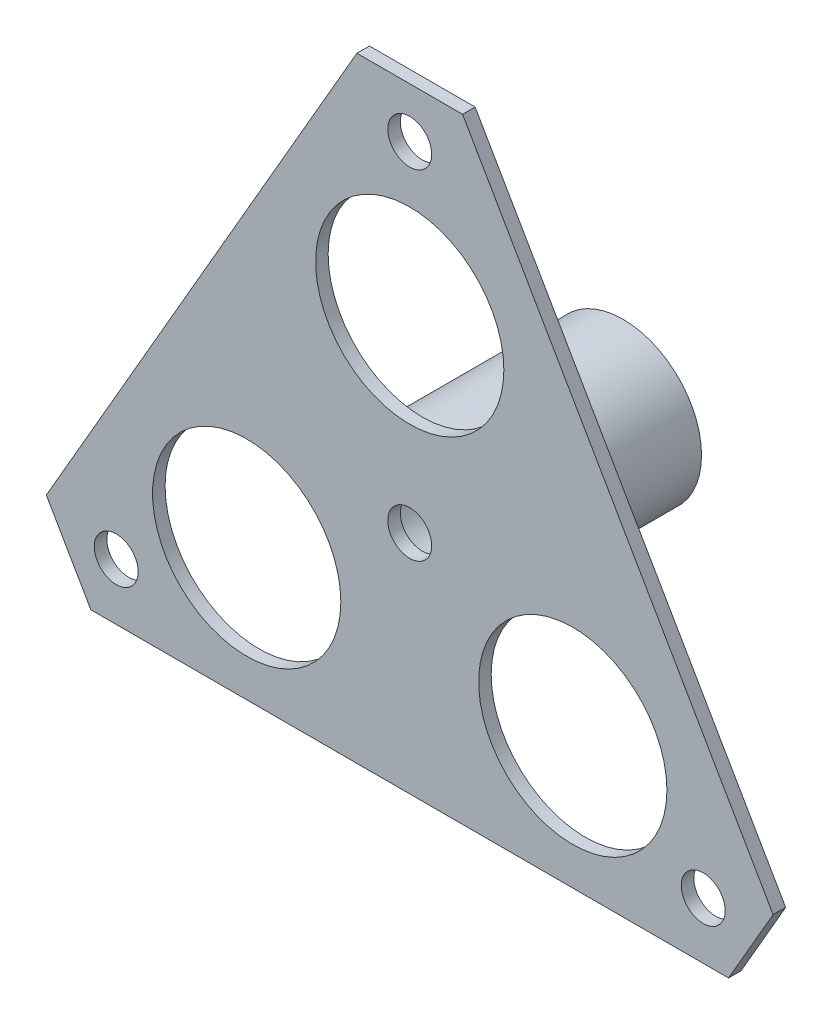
ISO-10303-21;
HEADER;
FILE_DESCRIPTION(('STEP AP214'),'2;1');
FILE_NAME('part.step','',(''),(''),'','','');
FILE_SCHEMA(('AUTOMOTIVE_DESIGN { 1 0 10303 214 1 1 1 1 }'));
ENDSEC;
DATA;
#1=APPLICATION_CONTEXT('core data for automotive mechanical design processes');
#2=APPLICATION_PROTOCOL_DEFINITION('international standard','automotive_design',2000,#1);
#3=PRODUCT_CONTEXT('',#1,'mechanical');
#4=PRODUCT('Part','Part','',(#3));
#5=PRODUCT_RELATED_PRODUCT_CATEGORY('part','',(#4));
#6=PRODUCT_DEFINITION_FORMATION('','',#4);
#7=PRODUCT_DEFINITION_CONTEXT('part definition',#1,'design');
#8=PRODUCT_DEFINITION('design','',#6,#7);
#9=PRODUCT_DEFINITION_SHAPE('','',#8);
#10=(LENGTH_UNIT() NAMED_UNIT(*) SI_UNIT(.MILLI.,.METRE.));
#11=(NAMED_UNIT(*) PLANE_ANGLE_UNIT() SI_UNIT($,.RADIAN.));
#12=(NAMED_UNIT(*) SI_UNIT($,.STERADIAN.) SOLID_ANGLE_UNIT());
#13=UNCERTAINTY_MEASURE_WITH_UNIT(LENGTH_MEASURE(1.E-05),#10,'distance_accuracy_value','');
#14=(GEOMETRIC_REPRESENTATION_CONTEXT(3) GLOBAL_UNCERTAINTY_ASSIGNED_CONTEXT((#13)) GLOBAL_UNIT_ASSIGNED_CONTEXT((#10,
#11,#12)) REPRESENTATION_CONTEXT('',''));
#15=CARTESIAN_POINT('',(0.,0.,0.));
#16=DIRECTION('',(0.,0.,1.));
#17=DIRECTION('',(1.,0.,0.));
#18=AXIS2_PLACEMENT_3D('',#15,#16,#17);
#19=CARTESIAN_POINT('',(0.,0.,32.));
#20=DIRECTION('',(0.,0.,-1.));
#21=DIRECTION('',(-1.,0.,0.));
#22=AXIS2_PLACEMENT_3D('',#19,#20,#21);
#23=CYLINDRICAL_SURFACE('',#22,12.5);
#24=CARTESIAN_POINT('',(0.,0.,30.));
#25=DIRECTION('',(0.,0.,-1.));
#26=DIRECTION('',(-1.,0.,0.));
#27=AXIS2_PLACEMENT_3D('',#24,#25,#26);
#28=CIRCLE('',#27,12.5);
#29=CARTESIAN_POINT('',(-12.5,0.,30.));
#30=VERTEX_POINT('',#29);
#31=EDGE_CURVE('E11',#30,#30,#28,.T.);
#32=ORIENTED_EDGE('',*,*,#31,.T.);
#33=EDGE_LOOP('',(#32));
#34=FACE_BOUND('',#33,.T.);
#35=CARTESIAN_POINT('',(0.,0.,0.));
#36=DIRECTION('',(0.,0.,1.));
#37=DIRECTION('',(1.,0.,0.));
#38=AXIS2_PLACEMENT_3D('',#35,#36,#37);
#39=CIRCLE('',#38,12.5);
#40=CARTESIAN_POINT('',(12.5,0.,0.));
#41=VERTEX_POINT('',#40);
#42=EDGE_CURVE('E161',#41,#41,#39,.T.);
#43=ORIENTED_EDGE('',*,*,#42,.T.);
#44=EDGE_LOOP('',(#43));
#45=FACE_BOUND('',#44,.T.);
#46=ADVANCED_FACE('F26',(#34,#45),#23,.T.);
#47=CARTESIAN_POINT('',(0.,0.,0.));
#48=DIRECTION('',(0.,0.,1.));
#49=DIRECTION('',(1.,0.,0.));
#50=AXIS2_PLACEMENT_3D('',#47,#48,#49);
#51=PLANE('',#50);
#52=DIRECTION('',(0.,1.,0.));
#53=VECTOR('',#52,1.);
#54=CARTESIAN_POINT('',(-2.5,10.,0.));
#55=LINE('',#54,#53);
#56=CARTESIAN_POINT('',(-2.5,6.53834841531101,0.));
#57=VERTEX_POINT('',#56);
#58=CARTESIAN_POINT('',(-2.5,10.,0.));
#59=VERTEX_POINT('',#58);
#60=EDGE_CURVE('E137',#57,#59,#55,.T.);
#61=ORIENTED_EDGE('',*,*,#60,.F.);
#62=CARTESIAN_POINT('',(0.,0.,0.));
#63=DIRECTION('',(0.,0.,-1.));
#64=DIRECTION('',(-1.,0.,0.));
#65=AXIS2_PLACEMENT_3D('',#62,#63,#64);
#66=CIRCLE('',#65,7.);
#67=CARTESIAN_POINT('',(2.5,6.53834841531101,0.));
#68=VERTEX_POINT('',#67);
#69=EDGE_CURVE('E135',#68,#57,#66,.T.);
#70=ORIENTED_EDGE('',*,*,#69,.F.);
#71=DIRECTION('',(0.,-1.,0.));
#72=VECTOR('',#71,1.);
#73=CARTESIAN_POINT('',(2.5,6.53834841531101,0.));
#74=LINE('',#73,#72);
#75=CARTESIAN_POINT('',(2.5,10.,0.));
#76=VERTEX_POINT('',#75);
#77=EDGE_CURVE('E143',#76,#68,#74,.T.);
#78=ORIENTED_EDGE('',*,*,#77,.F.);
#79=DIRECTION('',(1.,0.,0.));
#80=VECTOR('',#79,1.);
#81=CARTESIAN_POINT('',(2.5,10.,0.));
#82=LINE('',#81,#80);
#83=EDGE_CURVE('E140',#59,#76,#82,.T.);
#84=ORIENTED_EDGE('',*,*,#83,.F.);
#85=EDGE_LOOP('',(#61,#70,#78,#84));
#86=FACE_BOUND('',#85,.T.);
#87=ORIENTED_EDGE('',*,*,#42,.F.);
#88=EDGE_LOOP('',(#87));
#89=FACE_BOUND('',#88,.T.);
#90=ADVANCED_FACE('F190',(#86,#89),#51,.F.);
#91=CARTESIAN_POINT('',(0.,0.,32.));
#92=DIRECTION('',(0.,0.,-1.));
#93=DIRECTION('',(-1.,0.,0.));
#94=AXIS2_PLACEMENT_3D('',#91,#92,#93);
#95=CYLINDRICAL_SURFACE('',#94,7.);
#96=ORIENTED_EDGE('',*,*,#69,.T.);
#97=DIRECTION('',(0.,0.,-1.));
#98=VECTOR('',#97,1.);
#99=CARTESIAN_POINT('',(-2.5,6.53834841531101,32.));
#100=LINE('',#99,#98);
#101=CARTESIAN_POINT('',(-2.5,6.53834841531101,32.));
#102=VERTEX_POINT('',#101);
#103=EDGE_CURVE('E158',#102,#57,#100,.T.);
#104=ORIENTED_EDGE('',*,*,#103,.F.);
#105=CARTESIAN_POINT('',(0.,0.,32.));
#106=DIRECTION('',(0.,0.,-1.));
#107=DIRECTION('',(-1.,0.,0.));
#108=AXIS2_PLACEMENT_3D('',#105,#106,#107);
#109=CIRCLE('',#108,7.);
#110=CARTESIAN_POINT('',(2.5,6.53834841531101,32.));
#111=VERTEX_POINT('',#110);
#112=EDGE_CURVE('E146',#111,#102,#109,.T.);
#113=ORIENTED_EDGE('',*,*,#112,.F.);
#114=DIRECTION('',(0.,0.,-1.));
#115=VECTOR('',#114,1.);
#116=CARTESIAN_POINT('',(2.5,6.53834841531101,32.));
#117=LINE('',#116,#115);
#118=EDGE_CURVE('E159',#111,#68,#117,.T.);
#119=ORIENTED_EDGE('',*,*,#118,.T.);
#120=EDGE_LOOP('',(#96,#104,#113,#119));
#121=FACE_BOUND('',#120,.T.);
#122=ADVANCED_FACE('F195',(#121),#95,.F.);
#123=CARTESIAN_POINT('',(2.5,6.53834841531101,32.));
#124=DIRECTION('',(1.,0.,0.));
#125=DIRECTION('',(0.,0.,-1.));
#126=AXIS2_PLACEMENT_3D('',#123,#124,#125);
#127=PLANE('',#126);
#128=ORIENTED_EDGE('',*,*,#77,.T.);
#129=ORIENTED_EDGE('',*,*,#118,.F.);
#130=DIRECTION('',(0.,-1.,0.));
#131=VECTOR('',#130,1.);
#132=CARTESIAN_POINT('',(2.5,6.53834841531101,32.));
#133=LINE('',#132,#131);
#134=CARTESIAN_POINT('',(2.5,10.,32.));
#135=VERTEX_POINT('',#134);
#136=EDGE_CURVE('E155',#135,#111,#133,.T.);
#137=ORIENTED_EDGE('',*,*,#136,.F.);
#138=DIRECTION('',(0.,0.,-1.));
#139=VECTOR('',#138,1.);
#140=CARTESIAN_POINT('',(2.5,10.,32.));
#141=LINE('',#140,#139);
#142=EDGE_CURVE('E162',#135,#76,#141,.T.);
#143=ORIENTED_EDGE('',*,*,#142,.T.);
#144=EDGE_LOOP('',(#128,#129,#137,#143));
#145=FACE_BOUND('',#144,.T.);
#146=ADVANCED_FACE('F203',(#145),#127,.F.);
#147=CARTESIAN_POINT('',(2.5,10.,32.));
#148=DIRECTION('',(0.,1.,0.));
#149=DIRECTION('',(0.,0.,1.));
#150=AXIS2_PLACEMENT_3D('',#147,#148,#149);
#151=PLANE('',#150);
#152=ORIENTED_EDGE('',*,*,#83,.T.);
#153=ORIENTED_EDGE('',*,*,#142,.F.);
#154=DIRECTION('',(1.,0.,0.));
#155=VECTOR('',#154,1.);
#156=CARTESIAN_POINT('',(2.5,10.,32.));
#157=LINE('',#156,#155);
#158=CARTESIAN_POINT('',(-2.5,10.,32.));
#159=VERTEX_POINT('',#158);
#160=EDGE_CURVE('E152',#159,#135,#157,.T.);
#161=ORIENTED_EDGE('',*,*,#160,.F.);
#162=DIRECTION('',(0.,0.,-1.));
#163=VECTOR('',#162,1.);
#164=CARTESIAN_POINT('',(-2.5,10.,32.));
#165=LINE('',#164,#163);
#166=EDGE_CURVE('E164',#159,#59,#165,.T.);
#167=ORIENTED_EDGE('',*,*,#166,.T.);
#168=EDGE_LOOP('',(#152,#153,#161,#167));
#169=FACE_BOUND('',#168,.T.);
#170=ADVANCED_FACE('F212',(#169),#151,.F.);
#171=CARTESIAN_POINT('',(-2.5,10.,32.));
#172=DIRECTION('',(-1.,0.,0.));
#173=DIRECTION('',(0.,-1.,0.));
#174=AXIS2_PLACEMENT_3D('',#171,#172,#173);
#175=PLANE('',#174);
#176=ORIENTED_EDGE('',*,*,#60,.T.);
#177=ORIENTED_EDGE('',*,*,#166,.F.);
#178=DIRECTION('',(0.,1.,0.));
#179=VECTOR('',#178,1.);
#180=CARTESIAN_POINT('',(-2.5,10.,32.));
#181=LINE('',#180,#179);
#182=EDGE_CURVE('E149',#102,#159,#181,.T.);
#183=ORIENTED_EDGE('',*,*,#182,.F.);
#184=ORIENTED_EDGE('',*,*,#103,.T.);
#185=EDGE_LOOP('',(#176,#177,#183,#184));
#186=FACE_BOUND('',#185,.T.);
#187=ADVANCED_FACE('F208',(#186),#175,.F.);
#188=CARTESIAN_POINT('',(-65.,-36.,32.));
#189=DIRECTION('',(0.,0.,-1.));
#190=DIRECTION('',(-1.,0.,0.));
#191=AXIS2_PLACEMENT_3D('',#188,#189,#190);
#192=PLANE('',#191);
#193=CARTESIAN_POINT('',(0.,0.,32.));
#194=DIRECTION('',(0.,0.,-1.));
#195=DIRECTION('',(-1.,0.,0.));
#196=AXIS2_PLACEMENT_3D('',#193,#194,#195);
#197=CIRCLE('',#196,3.5);
#198=CARTESIAN_POINT('',(-3.5,0.,32.));
#199=VERTEX_POINT('',#198);
#200=EDGE_CURVE('E357',#199,#199,#197,.T.);
#201=ORIENTED_EDGE('',*,*,#200,.F.);
#202=EDGE_LOOP('',(#201));
#203=FACE_BOUND('',#202,.T.);
#204=ORIENTED_EDGE('',*,*,#112,.T.);
#205=ORIENTED_EDGE('',*,*,#182,.T.);
#206=ORIENTED_EDGE('',*,*,#160,.T.);
#207=ORIENTED_EDGE('',*,*,#136,.T.);
#208=EDGE_LOOP('',(#204,#205,#206,#207));
#209=FACE_BOUND('',#208,.T.);
#210=ADVANCED_FACE('F211',(#203,#209),#192,.T.);
#211=CARTESIAN_POINT('',(0.,0.,32.));
#212=DIRECTION('',(0.,0.,-1.));
#213=DIRECTION('',(-1.,0.,0.));
#214=AXIS2_PLACEMENT_3D('',#211,#212,#213);
#215=CIRCLE('',#214,14.5);
#216=CARTESIAN_POINT('',(-14.5,0.,32.));
#217=VERTEX_POINT('',#216);
#218=EDGE_CURVE('E33',#217,#217,#215,.F.);
#219=ORIENTED_EDGE('',*,*,#218,.T.);
#220=EDGE_LOOP('',(#219));
#221=FACE_BOUND('',#220,.T.);
#222=DIRECTION('',(0.499999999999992,-0.866025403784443,0.));
#223=VECTOR('',#222,1.);
#224=CARTESIAN_POINT('',(-54.3551177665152,-29.8541743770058,32.));
#225=LINE('',#224,#223);
#226=CARTESIAN_POINT('',(-57.9034118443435,-23.7083487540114,32.));
#227=VERTEX_POINT('',#226);
#228=CARTESIAN_POINT('',(-50.8068236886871,-36.,32.));
#229=VERTEX_POINT('',#228);
#230=EDGE_CURVE('E119',#227,#229,#225,.T.);
#231=ORIENTED_EDGE('',*,*,#230,.F.);
#232=DIRECTION('',(-0.499999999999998,-0.86602540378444,0.));
#233=VECTOR('',#232,1.);
#234=CARTESIAN_POINT('',(-65.,-36.,32.));
#235=LINE('',#234,#233);
#236=CARTESIAN_POINT('',(-8.419673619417,62.,32.));
#237=VERTEX_POINT('',#236);
#238=EDGE_CURVE('E117',#237,#227,#235,.T.);
#239=ORIENTED_EDGE('',*,*,#238,.F.);
#240=DIRECTION('',(-1.,0.,0.));
#241=VECTOR('',#240,1.);
#242=CARTESIAN_POINT('',(-65.,62.,32.));
#243=LINE('',#242,#241);
#244=CARTESIAN_POINT('',(8.41967361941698,62.,32.));
#245=VERTEX_POINT('',#244);
#246=EDGE_CURVE('E404',#245,#237,#243,.T.);
#247=ORIENTED_EDGE('',*,*,#246,.F.);
#248=DIRECTION('',(-0.499999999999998,0.86602540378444,0.));
#249=VECTOR('',#248,1.);
#250=CARTESIAN_POINT('',(0.,76.5833024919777,32.));
#251=LINE('',#250,#249);
#252=CARTESIAN_POINT('',(57.9034118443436,-23.7083487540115,32.));
#253=VERTEX_POINT('',#252);
#254=EDGE_CURVE('E126',#253,#245,#251,.T.);
#255=ORIENTED_EDGE('',*,*,#254,.F.);
#256=DIRECTION('',(0.500000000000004,0.866025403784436,0.));
#257=VECTOR('',#256,1.);
#258=CARTESIAN_POINT('',(21.8551177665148,-86.1458256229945,32.));
#259=LINE('',#258,#257);
#260=CARTESIAN_POINT('',(50.806823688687,-36.,32.));
#261=VERTEX_POINT('',#260);
#262=EDGE_CURVE('E384',#261,#253,#259,.T.);
#263=ORIENTED_EDGE('',*,*,#262,.F.);
#264=DIRECTION('',(1.,0.,0.));
#265=VECTOR('',#264,1.);
#266=CARTESIAN_POINT('',(-65.,-36.,32.));
#267=LINE('',#266,#265);
#268=EDGE_CURVE('E130',#229,#261,#267,.T.);
#269=ORIENTED_EDGE('',*,*,#268,.F.);
#270=EDGE_LOOP('',(#231,#239,#247,#255,#263,#269));
#271=FACE_BOUND('',#270,.T.);
#272=CARTESIAN_POINT('',(-46.7653718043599,-26.9999999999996,32.));
#273=DIRECTION('',(0.,0.,-1.));
#274=DIRECTION('',(-1.,0.,0.));
#275=AXIS2_PLACEMENT_3D('',#272,#273,#274);
#276=CIRCLE('',#275,3.5);
#277=CARTESIAN_POINT('',(-50.2653718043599,-26.9999999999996,32.));
#278=VERTEX_POINT('',#277);
#279=EDGE_CURVE('E374',#278,#278,#276,.T.);
#280=ORIENTED_EDGE('',*,*,#279,.F.);
#281=EDGE_LOOP('',(#280));
#282=FACE_BOUND('',#281,.T.);
#283=CARTESIAN_POINT('',(-25.9807621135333,-14.9999999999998,32.));
#284=DIRECTION('',(0.,0.,-1.));
#285=DIRECTION('',(-1.,0.,0.));
#286=AXIS2_PLACEMENT_3D('',#283,#284,#285);
#287=CIRCLE('',#286,15.);
#288=CARTESIAN_POINT('',(-40.9807621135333,-14.9999999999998,32.));
#289=VERTEX_POINT('',#288);
#290=EDGE_CURVE('E380',#289,#289,#287,.T.);
#291=ORIENTED_EDGE('',*,*,#290,.F.);
#292=EDGE_LOOP('',(#291));
#293=FACE_BOUND('',#292,.T.);
#294=CARTESIAN_POINT('',(46.7653718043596,-27.0000000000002,32.));
#295=DIRECTION('',(0.,0.,-1.));
#296=DIRECTION('',(-1.,0.,0.));
#297=AXIS2_PLACEMENT_3D('',#294,#295,#296);
#298=CIRCLE('',#297,3.5);
#299=CARTESIAN_POINT('',(43.2653718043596,-27.0000000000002,32.));
#300=VERTEX_POINT('',#299);
#301=EDGE_CURVE('E392',#300,#300,#298,.T.);
#302=ORIENTED_EDGE('',*,*,#301,.F.);
#303=EDGE_LOOP('',(#302));
#304=FACE_BOUND('',#303,.T.);
#305=CARTESIAN_POINT('',(25.9807621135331,-15.0000000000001,32.));
#306=DIRECTION('',(0.,0.,-1.));
#307=DIRECTION('',(-1.,0.,0.));
#308=AXIS2_PLACEMENT_3D('',#305,#306,#307);
#309=CIRCLE('',#308,15.);
#310=CARTESIAN_POINT('',(10.9807621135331,-15.0000000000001,32.));
#311=VERTEX_POINT('',#310);
#312=EDGE_CURVE('E398',#311,#311,#309,.T.);
#313=ORIENTED_EDGE('',*,*,#312,.F.);
#314=EDGE_LOOP('',(#313));
#315=FACE_BOUND('',#314,.T.);
#316=CARTESIAN_POINT('',(0.,54.,32.));
#317=DIRECTION('',(0.,0.,-1.));
#318=DIRECTION('',(-1.,0.,0.));
#319=AXIS2_PLACEMENT_3D('',#316,#317,#318);
#320=CIRCLE('',#319,3.5);
#321=CARTESIAN_POINT('',(-3.5,54.,32.));
#322=VERTEX_POINT('',#321);
#323=EDGE_CURVE('E411',#322,#322,#320,.T.);
#324=ORIENTED_EDGE('',*,*,#323,.F.);
#325=EDGE_LOOP('',(#324));
#326=FACE_BOUND('',#325,.T.);
#327=CARTESIAN_POINT('',(0.,30.,32.));
#328=DIRECTION('',(0.,0.,-1.));
#329=DIRECTION('',(-1.,0.,0.));
#330=AXIS2_PLACEMENT_3D('',#327,#328,#329);
#331=CIRCLE('',#330,15.);
#332=CARTESIAN_POINT('',(-15.,30.,32.));
#333=VERTEX_POINT('',#332);
#334=EDGE_CURVE('E417',#333,#333,#331,.T.);
#335=ORIENTED_EDGE('',*,*,#334,.F.);
#336=EDGE_LOOP('',(#335));
#337=FACE_BOUND('',#336,.T.);
#338=ADVANCED_FACE('F174',(#221,#271,#282,#293,#304,#315,#326,#337),#192,.T.);
#339=CARTESIAN_POINT('',(-65.,-36.,34.));
#340=DIRECTION('',(0.86602540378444,-0.499999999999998,0.));
#341=DIRECTION('',(0.499999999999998,0.86602540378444,0.));
#342=AXIS2_PLACEMENT_3D('',#339,#340,#341);
#343=PLANE('',#342);
#344=ORIENTED_EDGE('',*,*,#238,.T.);
#345=DIRECTION('',(0.,0.,1.));
#346=VECTOR('',#345,1.);
#347=CARTESIAN_POINT('',(-57.9034118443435,-23.7083487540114,34.));
#348=LINE('',#347,#346);
#349=CARTESIAN_POINT('',(-57.9034118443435,-23.7083487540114,34.));
#350=VERTEX_POINT('',#349);
#351=EDGE_CURVE('E103',#227,#350,#348,.T.);
#352=ORIENTED_EDGE('',*,*,#351,.T.);
#353=DIRECTION('',(-0.499999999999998,-0.86602540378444,0.));
#354=VECTOR('',#353,1.);
#355=CARTESIAN_POINT('',(-65.,-36.,34.));
#356=LINE('',#355,#354);
#357=CARTESIAN_POINT('',(-8.419673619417,62.,34.));
#358=VERTEX_POINT('',#357);
#359=EDGE_CURVE('E115',#358,#350,#356,.T.);
#360=ORIENTED_EDGE('',*,*,#359,.F.);
#361=DIRECTION('',(0.,0.,-1.));
#362=VECTOR('',#361,1.);
#363=CARTESIAN_POINT('',(-8.41967361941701,62.,34.));
#364=LINE('',#363,#362);
#365=EDGE_CURVE('E406',#358,#237,#364,.T.);
#366=ORIENTED_EDGE('',*,*,#365,.T.);
#367=EDGE_LOOP('',(#344,#352,#360,#366));
#368=FACE_BOUND('',#367,.T.);
#369=ADVANCED_FACE('F113',(#368),#343,.F.);
#370=CARTESIAN_POINT('',(-65.,-36.,34.));
#371=DIRECTION('',(0.,1.,0.));
#372=DIRECTION('',(0.,0.,1.));
#373=AXIS2_PLACEMENT_3D('',#370,#371,#372);
#374=PLANE('',#373);
#375=DIRECTION('',(1.,0.,0.));
#376=VECTOR('',#375,1.);
#377=CARTESIAN_POINT('',(-65.,-36.,34.));
#378=LINE('',#377,#376);
#379=CARTESIAN_POINT('',(-50.8068236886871,-36.,34.));
#380=VERTEX_POINT('',#379);
#381=CARTESIAN_POINT('',(50.806823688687,-36.,34.));
#382=VERTEX_POINT('',#381);
#383=EDGE_CURVE('E125',#380,#382,#378,.T.);
#384=ORIENTED_EDGE('',*,*,#383,.F.);
#385=DIRECTION('',(0.,0.,-1.));
#386=VECTOR('',#385,1.);
#387=CARTESIAN_POINT('',(-50.8068236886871,-36.,34.));
#388=LINE('',#387,#386);
#389=EDGE_CURVE('E40',#380,#229,#388,.T.);
#390=ORIENTED_EDGE('',*,*,#389,.T.);
#391=ORIENTED_EDGE('',*,*,#268,.T.);
#392=DIRECTION('',(0.,0.,1.));
#393=VECTOR('',#392,1.);
#394=CARTESIAN_POINT('',(50.806823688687,-36.,34.));
#395=LINE('',#394,#393);
#396=EDGE_CURVE('E386',#261,#382,#395,.T.);
#397=ORIENTED_EDGE('',*,*,#396,.T.);
#398=EDGE_LOOP('',(#384,#390,#391,#397));
#399=FACE_BOUND('',#398,.T.);
#400=ADVANCED_FACE('F222',(#399),#374,.F.);
#401=CARTESIAN_POINT('',(0.,76.5833024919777,34.));
#402=DIRECTION('',(-0.86602540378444,-0.499999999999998,0.));
#403=DIRECTION('',(0.499999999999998,-0.86602540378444,0.));
#404=AXIS2_PLACEMENT_3D('',#401,#402,#403);
#405=PLANE('',#404);
#406=DIRECTION('',(-0.499999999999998,0.86602540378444,0.));
#407=VECTOR('',#406,1.);
#408=CARTESIAN_POINT('',(0.,76.5833024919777,34.));
#409=LINE('',#408,#407);
#410=CARTESIAN_POINT('',(57.9034118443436,-23.7083487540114,34.));
#411=VERTEX_POINT('',#410);
#412=CARTESIAN_POINT('',(8.41967361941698,62.,34.));
#413=VERTEX_POINT('',#412);
#414=EDGE_CURVE('E128',#411,#413,#409,.T.);
#415=ORIENTED_EDGE('',*,*,#414,.F.);
#416=DIRECTION('',(0.,0.,-1.));
#417=VECTOR('',#416,1.);
#418=CARTESIAN_POINT('',(57.9034118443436,-23.7083487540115,34.));
#419=LINE('',#418,#417);
#420=EDGE_CURVE('E48',#411,#253,#419,.T.);
#421=ORIENTED_EDGE('',*,*,#420,.T.);
#422=ORIENTED_EDGE('',*,*,#254,.T.);
#423=DIRECTION('',(0.,0.,1.));
#424=VECTOR('',#423,1.);
#425=CARTESIAN_POINT('',(8.41967361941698,62.,34.));
#426=LINE('',#425,#424);
#427=EDGE_CURVE('E401',#245,#413,#426,.T.);
#428=ORIENTED_EDGE('',*,*,#427,.T.);
#429=EDGE_LOOP('',(#415,#421,#422,#428));
#430=FACE_BOUND('',#429,.T.);
#431=ADVANCED_FACE('F225',(#430),#405,.F.);
#432=CARTESIAN_POINT('',(-65.,-36.,34.));
#433=DIRECTION('',(0.,0.,-1.));
#434=DIRECTION('',(-1.,0.,0.));
#435=AXIS2_PLACEMENT_3D('',#432,#433,#434);
#436=PLANE('',#435);
#437=CARTESIAN_POINT('',(0.,0.,34.));
#438=DIRECTION('',(0.,0.,1.));
#439=DIRECTION('',(1.,0.,0.));
#440=AXIS2_PLACEMENT_3D('',#437,#438,#439);
#441=CIRCLE('',#440,3.5);
#442=CARTESIAN_POINT('',(3.5,0.,34.));
#443=VERTEX_POINT('',#442);
#444=EDGE_CURVE('E365',#443,#443,#441,.T.);
#445=ORIENTED_EDGE('',*,*,#444,.F.);
#446=EDGE_LOOP('',(#445));
#447=FACE_BOUND('',#446,.T.);
#448=CARTESIAN_POINT('',(-46.7653718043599,-26.9999999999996,34.));
#449=DIRECTION('',(0.,0.,1.));
#450=DIRECTION('',(-0.499999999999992,0.866025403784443,0.));
#451=AXIS2_PLACEMENT_3D('',#448,#449,#450);
#452=CIRCLE('',#451,3.5);
#453=CARTESIAN_POINT('',(-48.5153718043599,-23.968911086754,34.));
#454=VERTEX_POINT('',#453);
#455=EDGE_CURVE('E118',#454,#454,#452,.T.);
#456=ORIENTED_EDGE('',*,*,#455,.F.);
#457=EDGE_LOOP('',(#456));
#458=FACE_BOUND('',#457,.T.);
#459=CARTESIAN_POINT('',(-25.9807621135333,-14.9999999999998,34.));
#460=DIRECTION('',(0.,0.,1.));
#461=DIRECTION('',(-0.499999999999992,0.866025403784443,0.));
#462=AXIS2_PLACEMENT_3D('',#459,#460,#461);
#463=CIRCLE('',#462,15.);
#464=CARTESIAN_POINT('',(-33.4807621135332,-2.00961894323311,34.));
#465=VERTEX_POINT('',#464);
#466=EDGE_CURVE('E377',#465,#465,#463,.T.);
#467=ORIENTED_EDGE('',*,*,#466,.F.);
#468=EDGE_LOOP('',(#467));
#469=FACE_BOUND('',#468,.T.);
#470=CARTESIAN_POINT('',(46.7653718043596,-27.0000000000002,34.));
#471=DIRECTION('',(0.,0.,1.));
#472=DIRECTION('',(-0.500000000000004,-0.866025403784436,0.));
#473=AXIS2_PLACEMENT_3D('',#470,#471,#472);
#474=CIRCLE('',#473,3.5);
#475=CARTESIAN_POINT('',(45.0153718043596,-30.0310889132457,34.));
#476=VERTEX_POINT('',#475);
#477=EDGE_CURVE('E389',#476,#476,#474,.T.);
#478=ORIENTED_EDGE('',*,*,#477,.F.);
#479=EDGE_LOOP('',(#478));
#480=FACE_BOUND('',#479,.T.);
#481=CARTESIAN_POINT('',(25.9807621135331,-15.0000000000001,34.));
#482=DIRECTION('',(0.,0.,1.));
#483=DIRECTION('',(-0.500000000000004,-0.866025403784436,0.));
#484=AXIS2_PLACEMENT_3D('',#481,#482,#483);
#485=CIRCLE('',#484,15.);
#486=CARTESIAN_POINT('',(18.480762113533,-27.9903810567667,34.));
#487=VERTEX_POINT('',#486);
#488=EDGE_CURVE('E395',#487,#487,#485,.T.);
#489=ORIENTED_EDGE('',*,*,#488,.F.);
#490=EDGE_LOOP('',(#489));
#491=FACE_BOUND('',#490,.T.);
#492=CARTESIAN_POINT('',(0.,54.,34.));
#493=DIRECTION('',(0.,0.,1.));
#494=DIRECTION('',(1.,0.,0.));
#495=AXIS2_PLACEMENT_3D('',#492,#493,#494);
#496=CIRCLE('',#495,3.5);
#497=CARTESIAN_POINT('',(3.5,54.,34.));
#498=VERTEX_POINT('',#497);
#499=EDGE_CURVE('E408',#498,#498,#496,.T.);
#500=ORIENTED_EDGE('',*,*,#499,.F.);
#501=EDGE_LOOP('',(#500));
#502=FACE_BOUND('',#501,.T.);
#503=CARTESIAN_POINT('',(0.,30.,34.));
#504=DIRECTION('',(0.,0.,1.));
#505=DIRECTION('',(1.,0.,0.));
#506=AXIS2_PLACEMENT_3D('',#503,#504,#505);
#507=CIRCLE('',#506,15.);
#508=CARTESIAN_POINT('',(15.,30.,34.));
#509=VERTEX_POINT('',#508);
#510=EDGE_CURVE('E414',#509,#509,#507,.T.);
#511=ORIENTED_EDGE('',*,*,#510,.F.);
#512=EDGE_LOOP('',(#511));
#513=FACE_BOUND('',#512,.T.);
#514=ORIENTED_EDGE('',*,*,#359,.T.);
#515=DIRECTION('',(0.499999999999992,-0.866025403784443,0.));
#516=VECTOR('',#515,1.);
#517=CARTESIAN_POINT('',(-54.3551177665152,-29.8541743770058,34.));
#518=LINE('',#517,#516);
#519=EDGE_CURVE('E100',#350,#380,#518,.T.);
#520=ORIENTED_EDGE('',*,*,#519,.T.);
#521=ORIENTED_EDGE('',*,*,#383,.T.);
#522=DIRECTION('',(0.500000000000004,0.866025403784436,0.));
#523=VECTOR('',#522,1.);
#524=CARTESIAN_POINT('',(21.8551177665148,-86.1458256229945,34.));
#525=LINE('',#524,#523);
#526=EDGE_CURVE('E108',#382,#411,#525,.T.);
#527=ORIENTED_EDGE('',*,*,#526,.T.);
#528=ORIENTED_EDGE('',*,*,#414,.T.);
#529=DIRECTION('',(-1.,0.,0.));
#530=VECTOR('',#529,1.);
#531=CARTESIAN_POINT('',(-65.,62.,34.));
#532=LINE('',#531,#530);
#533=EDGE_CURVE('E124',#413,#358,#532,.T.);
#534=ORIENTED_EDGE('',*,*,#533,.T.);
#535=EDGE_LOOP('',(#514,#520,#521,#527,#528,#534));
#536=FACE_BOUND('',#535,.T.);
#537=ADVANCED_FACE('F122',(#447,#458,#469,#480,#491,#502,#513,#536),#436,.F.);
#538=CARTESIAN_POINT('',(0.,30.,0.));
#539=DIRECTION('',(0.,0.,1.));
#540=DIRECTION('',(1.,0.,0.));
#541=AXIS2_PLACEMENT_3D('',#538,#539,#540);
#542=CYLINDRICAL_SURFACE('',#541,15.);
#543=ORIENTED_EDGE('',*,*,#334,.T.);
#544=EDGE_LOOP('',(#543));
#545=FACE_BOUND('',#544,.T.);
#546=ORIENTED_EDGE('',*,*,#510,.T.);
#547=EDGE_LOOP('',(#546));
#548=FACE_BOUND('',#547,.T.);
#549=ADVANCED_FACE('F232',(#545,#548),#542,.F.);
#550=CARTESIAN_POINT('',(0.,54.,0.));
#551=DIRECTION('',(0.,0.,1.));
#552=DIRECTION('',(1.,0.,0.));
#553=AXIS2_PLACEMENT_3D('',#550,#551,#552);
#554=CYLINDRICAL_SURFACE('',#553,3.5);
#555=ORIENTED_EDGE('',*,*,#323,.T.);
#556=EDGE_LOOP('',(#555));
#557=FACE_BOUND('',#556,.T.);
#558=ORIENTED_EDGE('',*,*,#499,.T.);
#559=EDGE_LOOP('',(#558));
#560=FACE_BOUND('',#559,.T.);
#561=ADVANCED_FACE('F237',(#557,#560),#554,.F.);
#562=CARTESIAN_POINT('',(-22.9005350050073,62.,0.));
#563=DIRECTION('',(0.,-1.,0.));
#564=DIRECTION('',(0.,0.,-1.));
#565=AXIS2_PLACEMENT_3D('',#562,#563,#564);
#566=PLANE('',#565);
#567=ORIENTED_EDGE('',*,*,#533,.F.);
#568=ORIENTED_EDGE('',*,*,#427,.F.);
#569=ORIENTED_EDGE('',*,*,#246,.T.);
#570=ORIENTED_EDGE('',*,*,#365,.F.);
#571=EDGE_LOOP('',(#567,#568,#569,#570));
#572=FACE_BOUND('',#571,.T.);
#573=ADVANCED_FACE('F241',(#572),#566,.F.);
#574=CARTESIAN_POINT('',(25.9807621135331,-15.0000000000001,0.));
#575=DIRECTION('',(0.,0.,1.));
#576=DIRECTION('',(1.,0.,0.));
#577=AXIS2_PLACEMENT_3D('',#574,#575,#576);
#578=CYLINDRICAL_SURFACE('',#577,15.);
#579=ORIENTED_EDGE('',*,*,#312,.T.);
#580=EDGE_LOOP('',(#579));
#581=FACE_BOUND('',#580,.T.);
#582=ORIENTED_EDGE('',*,*,#488,.T.);
#583=EDGE_LOOP('',(#582));
#584=FACE_BOUND('',#583,.T.);
#585=ADVANCED_FACE('F245',(#581,#584),#578,.F.);
#586=CARTESIAN_POINT('',(46.7653718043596,-27.0000000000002,0.));
#587=DIRECTION('',(0.,0.,1.));
#588=DIRECTION('',(1.,0.,0.));
#589=AXIS2_PLACEMENT_3D('',#586,#587,#588);
#590=CYLINDRICAL_SURFACE('',#589,3.5);
#591=ORIENTED_EDGE('',*,*,#301,.T.);
#592=EDGE_LOOP('',(#591));
#593=FACE_BOUND('',#592,.T.);
#594=ORIENTED_EDGE('',*,*,#477,.T.);
#595=EDGE_LOOP('',(#594));
#596=FACE_BOUND('',#595,.T.);
#597=ADVANCED_FACE('F249',(#593,#596),#590,.F.);
#598=CARTESIAN_POINT('',(65.1438425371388,-11.1675549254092,0.));
#599=DIRECTION('',(-0.866025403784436,0.500000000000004,0.));
#600=DIRECTION('',(-0.500000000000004,-0.866025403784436,0.));
#601=AXIS2_PLACEMENT_3D('',#598,#599,#600);
#602=PLANE('',#601);
#603=ORIENTED_EDGE('',*,*,#262,.T.);
#604=ORIENTED_EDGE('',*,*,#420,.F.);
#605=ORIENTED_EDGE('',*,*,#526,.F.);
#606=ORIENTED_EDGE('',*,*,#396,.F.);
#607=EDGE_LOOP('',(#603,#604,#605,#606));
#608=FACE_BOUND('',#607,.T.);
#609=ADVANCED_FACE('F253',(#608),#602,.F.);
#610=CARTESIAN_POINT('',(-25.9807621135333,-14.9999999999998,0.));
#611=DIRECTION('',(0.,0.,1.));
#612=DIRECTION('',(1.,0.,0.));
#613=AXIS2_PLACEMENT_3D('',#610,#611,#612);
#614=CYLINDRICAL_SURFACE('',#613,15.);
#615=ORIENTED_EDGE('',*,*,#290,.T.);
#616=EDGE_LOOP('',(#615));
#617=FACE_BOUND('',#616,.T.);
#618=ORIENTED_EDGE('',*,*,#466,.T.);
#619=EDGE_LOOP('',(#618));
#620=FACE_BOUND('',#619,.T.);
#621=ADVANCED_FACE('F257',(#617,#620),#614,.F.);
#622=CARTESIAN_POINT('',(-46.7653718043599,-26.9999999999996,0.));
#623=DIRECTION('',(0.,0.,1.));
#624=DIRECTION('',(1.,0.,0.));
#625=AXIS2_PLACEMENT_3D('',#622,#623,#624);
#626=CYLINDRICAL_SURFACE('',#625,3.5);
#627=ORIENTED_EDGE('',*,*,#279,.T.);
#628=EDGE_LOOP('',(#627));
#629=FACE_BOUND('',#628,.T.);
#630=ORIENTED_EDGE('',*,*,#455,.T.);
#631=EDGE_LOOP('',(#630));
#632=FACE_BOUND('',#631,.T.);
#633=ADVANCED_FACE('F260',(#629,#632),#626,.F.);
#634=CARTESIAN_POINT('',(-42.243307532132,-50.8324450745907,0.));
#635=DIRECTION('',(0.866025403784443,0.499999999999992,0.));
#636=DIRECTION('',(-0.499999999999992,0.866025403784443,0.));
#637=AXIS2_PLACEMENT_3D('',#634,#635,#636);
#638=PLANE('',#637);
#639=ORIENTED_EDGE('',*,*,#230,.T.);
#640=ORIENTED_EDGE('',*,*,#389,.F.);
#641=ORIENTED_EDGE('',*,*,#519,.F.);
#642=ORIENTED_EDGE('',*,*,#351,.F.);
#643=EDGE_LOOP('',(#639,#640,#641,#642));
#644=FACE_BOUND('',#643,.T.);
#645=ADVANCED_FACE('F102',(#644),#638,.F.);
#646=CARTESIAN_POINT('',(0.,0.,0.));
#647=DIRECTION('',(0.,0.,1.));
#648=DIRECTION('',(1.,0.,0.));
#649=AXIS2_PLACEMENT_3D('',#646,#647,#648);
#650=CYLINDRICAL_SURFACE('',#649,3.5);
#651=ORIENTED_EDGE('',*,*,#200,.T.);
#652=EDGE_LOOP('',(#651));
#653=FACE_BOUND('',#652,.T.);
#654=ORIENTED_EDGE('',*,*,#444,.T.);
#655=EDGE_LOOP('',(#654));
#656=FACE_BOUND('',#655,.T.);
#657=ADVANCED_FACE('F179',(#653,#656),#650,.F.);
#658=CARTESIAN_POINT('',(0.,0.,32.));
#659=DIRECTION('',(0.,0.,1.));
#660=DIRECTION('',(1.,0.,0.));
#661=AXIS2_PLACEMENT_3D('',#658,#659,#660);
#662=CONICAL_SURFACE('',#661,14.5,0.785398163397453);
#663=ORIENTED_EDGE('',*,*,#31,.F.);
#664=EDGE_LOOP('',(#663));
#665=FACE_BOUND('',#664,.T.);
#666=ORIENTED_EDGE('',*,*,#218,.F.);
#667=EDGE_LOOP('',(#666));
#668=FACE_BOUND('',#667,.T.);
#669=ADVANCED_FACE('F177',(#665,#668),#662,.T.);
#670=CLOSED_SHELL('',(#46,#90,#122,#146,#170,#187,#210,#338,#369,#400,#431,#537,#549,#561,#573,
#585,#597,#609,#621,#633,#645,#657,#669));
#671=MANIFOLD_SOLID_BREP('B2',#670);
#672=ADVANCED_BREP_SHAPE_REPRESENTATION('',(#18,#671),#14);
#673=SHAPE_DEFINITION_REPRESENTATION(#9,#672);
ENDSEC;
END-ISO-10303-21;
